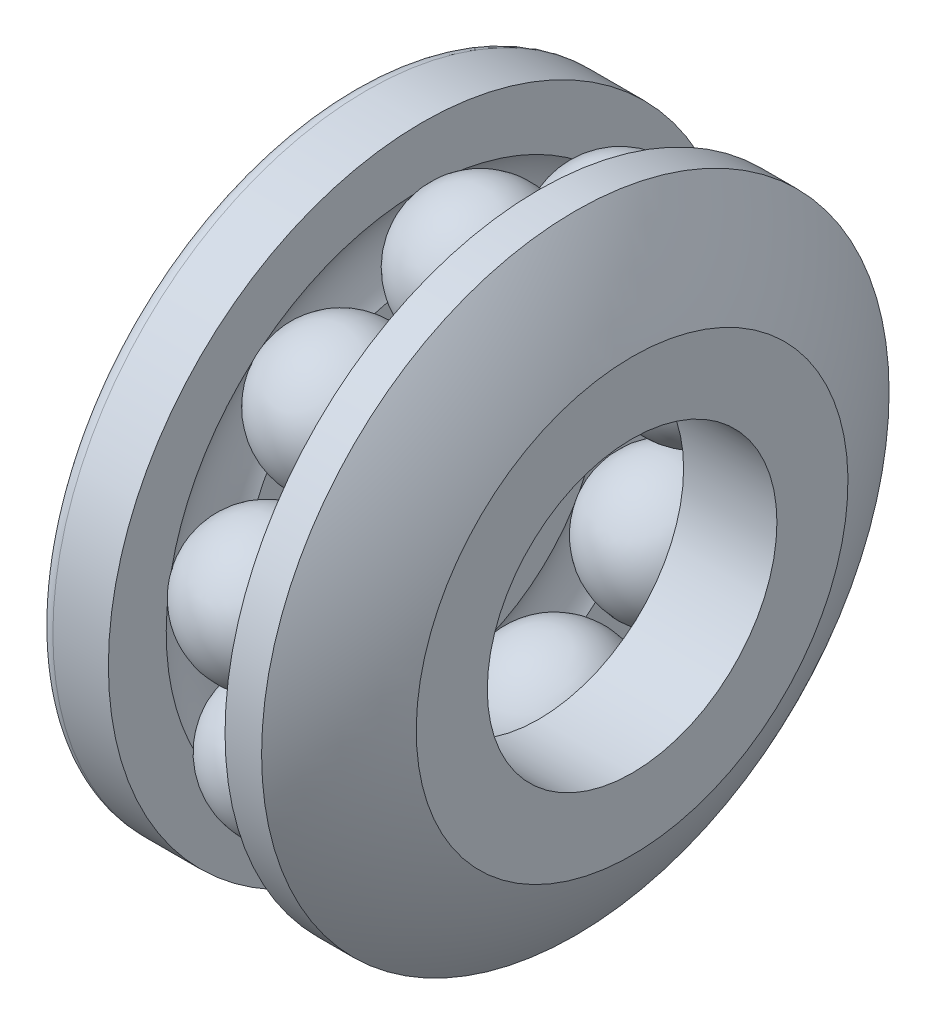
from build123d import *

# Parameters (mm, degrees)
FILLET2_R               = 0.6
CIRCULAR_PATTERN1_COUNT = 9


with BuildPart() as part:
    # Sketch1 → Revolve1 (revolve)
    with BuildSketch(Plane.XY):
        with BuildLine():
            Line((-5.316666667, 13), (-5.316666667, 5))
            Line((-5.316666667, 5), (-2.416666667, 5))
            Line((-2.416666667, 5), (-2.416666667, 7.396964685))
            ThreePointArc((-2.416666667, 7.396964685), (-2.9, 9), (-2.416666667, 10.603035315))
            Line((-2.416666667, 10.603035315), (-2.416666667, 13))
            Line((-2.416666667, 13), (-5.316666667, 13))
        make_face()
    revolve(axis=Axis((-5.316666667, 0, 0), (-1, 0, 0)))

    # Sketch2 → Revolve2 (revolve)
    with BuildSketch(Plane.XY):
        with BuildLine():
            Line((0, 11.91), (0, 6.09))
            ThreePointArc((0, 6.09), (-2.91, 9), (0, 11.91))
        make_face()
    revolve2 = revolve(axis=Axis((0, 6.09, 0), (0, 1, 0)))

    # Sketch3 → Revolve3 (revolve)
    with BuildSketch(Plane.XY):
        with BuildLine():
            Line((6.283333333, 6), (6.283333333, 8.943712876))
            ThreePointArc((6.283333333, 8.943712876), (5.215823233, 11.0346875), (3.931572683, 13))
            Line((3.931572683, 13), (2.416666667, 13))
            Line((2.416666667, 13), (2.416666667, 10.603035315))
            ThreePointArc((2.416666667, 10.603035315), (2.9, 9), (2.416666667, 7.396964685))
            Line((2.416666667, 7.396964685), (2.416666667, 6))
            Line((2.416666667, 6), (6.283333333, 6))
        make_face()
    revolve(axis=Axis((-5.316666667, 0, 0), (-1, 0, 0)))

    # Fillet2
    fillet2_edges = [part.edges().sort_by_distance(p)[0] for p in [
        (-5.316666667, -5, 0),
        (-5.316666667, -13, 0),
    ]]
    fillet(fillet2_edges, radius=FILLET2_R)

    # Circular-Pattern1: Revolve2 ×9 about axis
    circular_pattern1_axis = Axis((0, 0, 0), (1, 0, 0))
    for i in range(1, CIRCULAR_PATTERN1_COUNT):
        add(revolve2.rotate(circular_pattern1_axis, i * 360 / CIRCULAR_PATTERN1_COUNT))


solid = part.part
